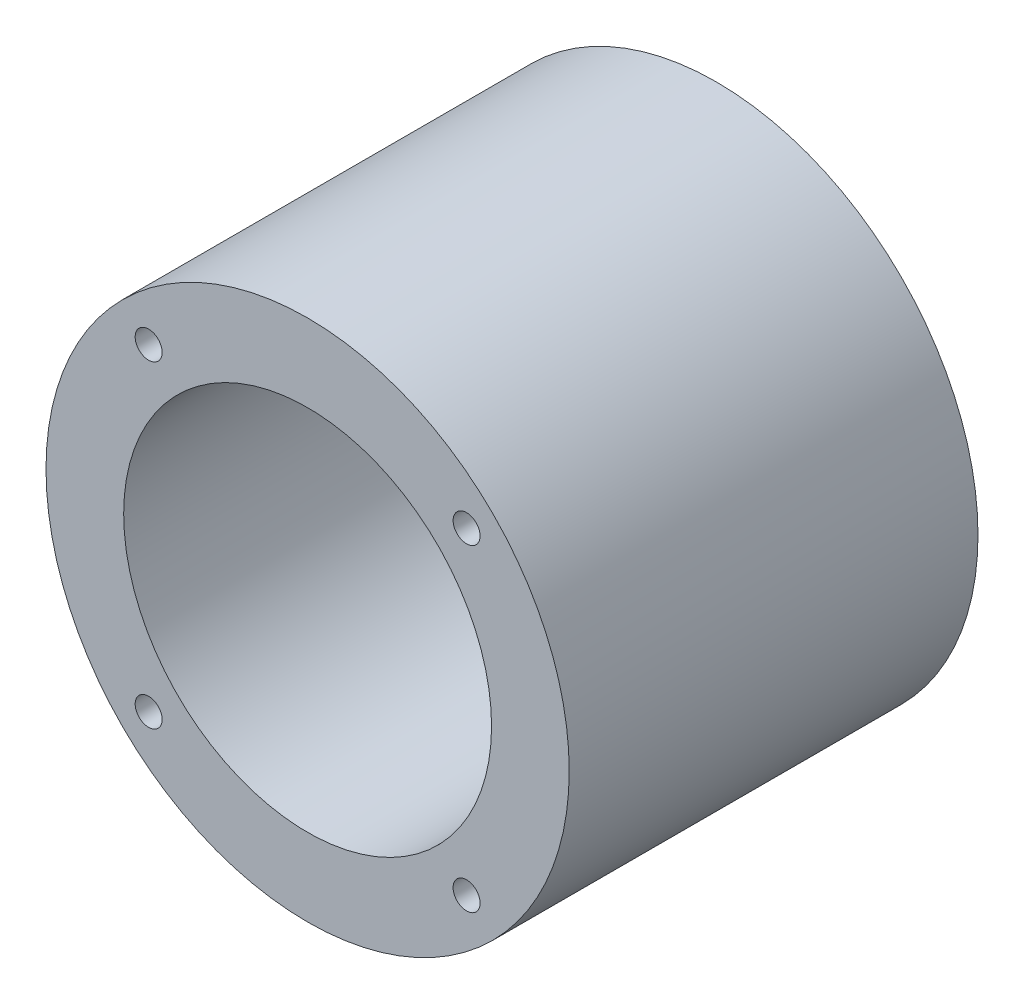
from build123d import *

# Parameters (mm, degrees)
SKIZZE1_R                       = 64
SKIZZE1_R_2                     = 3.3
AUFSATZ_LINEAR_AUSTRAGEN1_DEPTH = 100
SKIZZE2_R                       = 45
SCHNITT_LINEAR_AUSTRAGEN1_DEPTH = 100


with BuildPart() as part:
    # Skizze1 → Aufsatz-Linear austragen1 (new body)
    with BuildSketch(Plane(origin=(0, 0, 0), x_dir=(-1, 0, 0), z_dir=(0, 0, 1))):
        with Locations(Location((0, 0, 0), (0, 0, 180))):
            Circle(SKIZZE1_R)
        with Locations(Location((-38.890872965, 38.890872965, 0), (0, 0, 180))):
            Circle(SKIZZE1_R_2, mode=Mode.SUBTRACT)
        with Locations(Location((38.890872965, 38.890872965, 0), (0, 0, 180))):
            Circle(SKIZZE1_R_2, mode=Mode.SUBTRACT)
        with Locations(Location((38.890872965, -38.890872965, 0), (0, 0, 180))):
            Circle(SKIZZE1_R_2, mode=Mode.SUBTRACT)
        with Locations(Location((-38.890872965, -38.890872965, 0), (0, 0, 180))):
            Circle(SKIZZE1_R_2, mode=Mode.SUBTRACT)
    extrude(amount=AUFSATZ_LINEAR_AUSTRAGEN1_DEPTH)

    # Skizze2 → Schnitt-Linear austragen1 (cut)
    with BuildSketch(Plane.XY.offset(100)):
        Circle(SKIZZE2_R)
    extrude(amount=-SCHNITT_LINEAR_AUSTRAGEN1_DEPTH, mode=Mode.SUBTRACT)


solid = part.part
